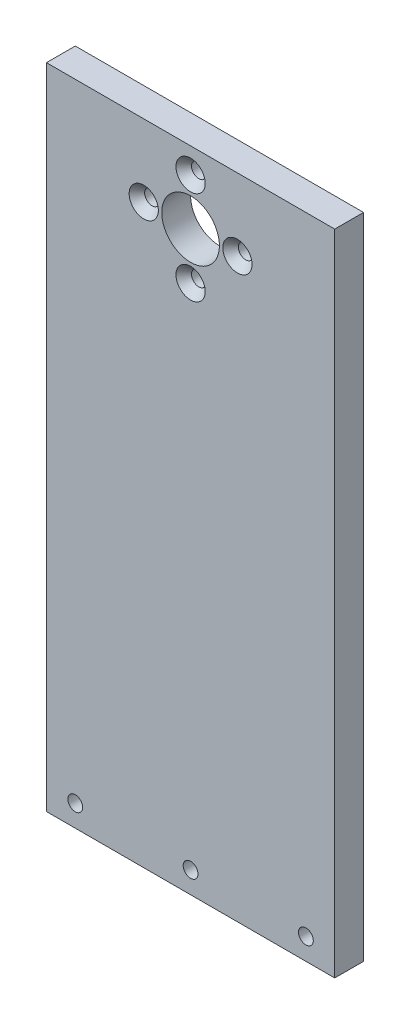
from build123d import *

# Parameters (mm, degrees)
SKETCH1_W                                        = 127
SKETCH1_H                                        = 285.75
BOSS_EXTRUDE1_DEPTH                              = 12.7
F_1_1_DIAMETER_HOLE1_D                           = 25.4
CSK_FOR_1_4_FLAT_HEAD_MACHINE_SCREW1_D           = 6.5278
CSK_FOR_1_4_FLAT_HEAD_MACHINE_SCREW1_CSINK_D     = 12.8778
CSK_FOR_1_4_FLAT_HEAD_MACHINE_SCREW1_CSINK_ANGLE = 82
CBORE_FOR_1_4_SOCKET_HEAD_CAP_SCREW1_D           = 6.5278
CBORE_FOR_1_4_SOCKET_HEAD_CAP_SCREW1_CBORE_D     = 11.1125
CBORE_FOR_1_4_SOCKET_HEAD_CAP_SCREW1_CBORE_DEPTH = 6.35


with BuildPart() as part:
    # Sketch1 → Boss-Extrude1 (new body)
    with BuildSketch(Plane.XY):
        with Locations((0, -111.125)):
            Rectangle(SKETCH1_W, SKETCH1_H)
    extrude(amount=BOSS_EXTRUDE1_DEPTH)

    # 1 _1_ Diameter Hole1 (through all)
    with Locations(Plane.XY.offset(12.7)):
        with Locations((0, 0)):
            Hole(F_1_1_DIAMETER_HOLE1_D / 2)

    # CSK for 1_4 Flat Head Machine Screw1 (through all)
    with Locations(Plane.XY.offset(12.7)):
        with Locations((-20.6375, 0), (0, 20.6375), (20.6375, 0), (0, -20.6375)):
            CounterSinkHole(CSK_FOR_1_4_FLAT_HEAD_MACHINE_SCREW1_D / 2, CSK_FOR_1_4_FLAT_HEAD_MACHINE_SCREW1_CSINK_D / 2, counter_sink_angle=CSK_FOR_1_4_FLAT_HEAD_MACHINE_SCREW1_CSINK_ANGLE)

    # CBORE for 1_4 Socket Head Cap Screw1 (through all)
    with Locations(Plane(origin=(4.500976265, 76.792579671, 0), x_dir=(1, 0, 0), z_dir=(0, 0, -1))):
        with Locations((-55.300976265, 321.267579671), (-4.500976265, 321.267579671), (46.299023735, 321.267579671)):
            CounterBoreHole(CBORE_FOR_1_4_SOCKET_HEAD_CAP_SCREW1_D / 2, CBORE_FOR_1_4_SOCKET_HEAD_CAP_SCREW1_CBORE_D / 2, CBORE_FOR_1_4_SOCKET_HEAD_CAP_SCREW1_CBORE_DEPTH)


solid = part.part
